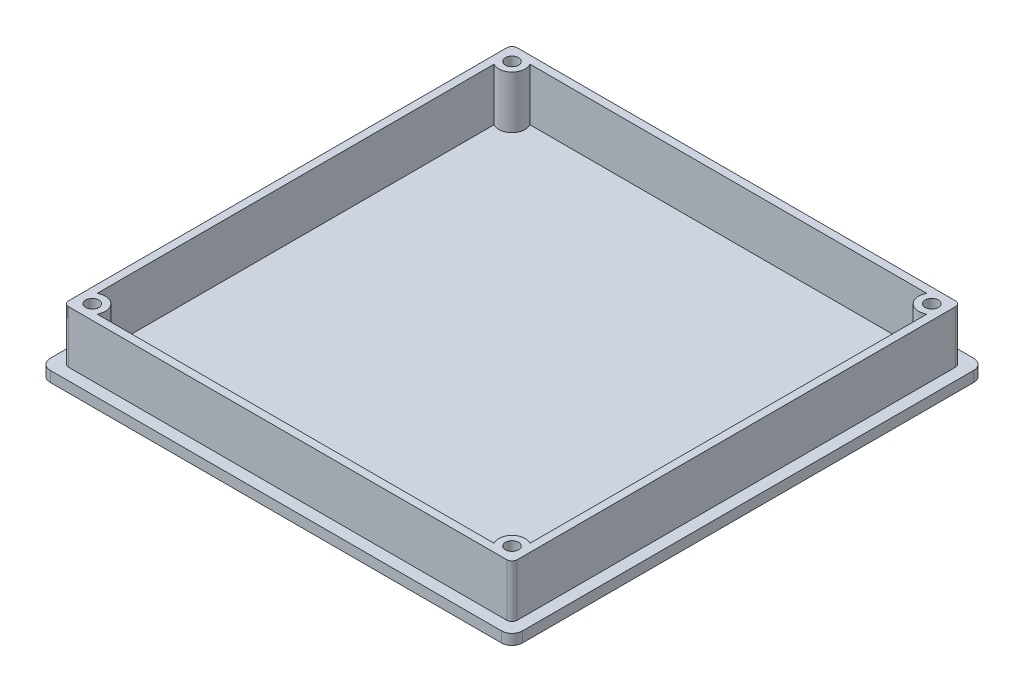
from build123d import *

# Parameters (mm, degrees)
SKIZZE1_W                       = 180
SKIZZE1_H                       = 180
AUFSATZ_LINEAR_AUSTRAGEN1_DEPTH = 4
SKIZZE2_W                       = 171
SKIZZE2_H                       = 171
SKIZZE2_W_2                     = 165
SKIZZE2_H_2                     = 165
AUFSATZ_LINEAR_AUSTRAGEN2_DEPTH = 20
SKIZZE4_R                       = 5
AUFSATZ_LINEAR_AUSTRAGEN4_DEPTH = 24
SKIZZE5_R                       = 2.5
SCHNITT_LINEAR_AUSTRAGEN1_DEPTH = 130.52219887
FASE1_SIZE                      = 3.5
LINEARES_MUSTER2_COUNT          = 2
LINEARES_MUSTER2_PITCH          = 160
LINEARES_MUSTER2_COUNT_DIR2     = 2
LINEARES_MUSTER2_PITCH_DIR2     = 160
FASE1_OF_LINEARES_MUSTER2_SIZE  = 3.5
VERRUNDUNG2_R                   = 2
VERRUNDUNG3_R                   = 4


with BuildPart() as part:
    # Skizze1 → Aufsatz-Linear austragen1 (new body)
    with BuildSketch(Plane(origin=(0, 0, 0), x_dir=(1, 0, 0), z_dir=(0, 1, 0))):
        Rectangle(SKIZZE1_W, SKIZZE1_H)
    extrude(amount=AUFSATZ_LINEAR_AUSTRAGEN1_DEPTH)

    # Skizze2 → Aufsatz-Linear austragen2 (add)
    with BuildSketch(Plane(origin=(0, 4, 0), x_dir=(1, 0, 0), z_dir=(0, 1, 0))):
        Rectangle(SKIZZE2_W, SKIZZE2_H)
        Rectangle(SKIZZE2_W_2, SKIZZE2_H_2, mode=Mode.SUBTRACT)
    extrude(amount=AUFSATZ_LINEAR_AUSTRAGEN2_DEPTH)

    # Skizze4 → Aufsatz-Linear austragen4 (add)
    with BuildSketch(Plane(origin=(0, 0, 0), x_dir=(1, 0, 0), z_dir=(0, 1, 0))):
        with Locations((-80, 80)):
            Circle(SKIZZE4_R)
    aufsatz_linear_austragen4 = extrude(amount=AUFSATZ_LINEAR_AUSTRAGEN4_DEPTH)

    # Skizze5 → Schnitt-Linear austragen1 (cut, through all)
    with BuildSketch(Plane(origin=(0, 0, 0), x_dir=(1, 0, 0), z_dir=(0, 1, 0))):
        with Locations(Location((-80, 80, 0), (0, 0, 270))):
            Circle(SKIZZE5_R)
    schnitt_linear_austragen1 = extrude(amount=SCHNITT_LINEAR_AUSTRAGEN1_DEPTH, mode=Mode.SUBTRACT)

    # Fase1
    fase1_edges = [part.edges().sort_by_distance(p)[0] for p in [
        (-80, 0, -82.5),
    ]]
    chamfer(fase1_edges, length=FASE1_SIZE)

    # Lineares Muster2: Aufsatz-Linear austragen4, Schnitt-Linear austragen1 2 × 2
    with Locations(*[(j * LINEARES_MUSTER2_PITCH_DIR2, 0, i * LINEARES_MUSTER2_PITCH) for i in range(LINEARES_MUSTER2_COUNT) for j in range(LINEARES_MUSTER2_COUNT_DIR2) if (i, j) != (0, 0)]):
        add(aufsatz_linear_austragen4)
        add(schnitt_linear_austragen1, mode=Mode.SUBTRACT)

    # Fase1 of Lineares Muster2
    fase1_of_lineares_muster2_edges = [part.edges().sort_by_distance(p)[0] for p in [
        (80, 0, -82.5),
        (-80, 0, 77.5),
        (80, 0, 77.5),
    ]]
    chamfer(fase1_of_lineares_muster2_edges, length=FASE1_OF_LINEARES_MUSTER2_SIZE)

    # Verrundung2
    verrundung2_edges = [part.edges().sort_by_distance(p)[0] for p in [
        (85.5, 14, -85.5),
        (-85.5, 14, -85.5),
        (-85.5, 14, 85.5),
        (85.5, 14, 85.5),
    ]]
    fillet(verrundung2_edges, radius=VERRUNDUNG2_R)

    # Verrundung3
    verrundung3_edges = [part.edges().sort_by_distance(p)[0] for p in [
        (-90, 2, -90),
        (90, 2, -90),
        (90, 2, 90),
        (-90, 2, 90),
    ]]
    fillet(verrundung3_edges, radius=VERRUNDUNG3_R)


solid = part.part
